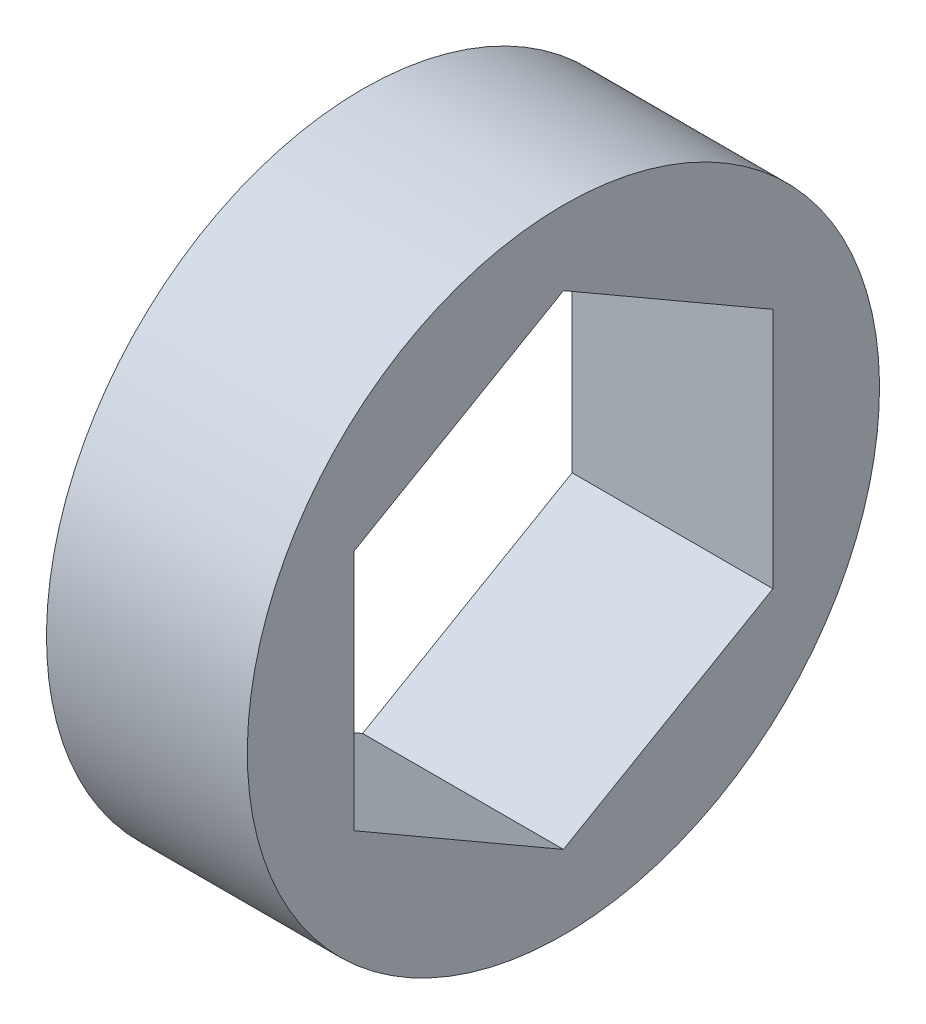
ISO-10303-21;
HEADER;
FILE_DESCRIPTION(('STEP AP214'),'2;1');
FILE_NAME('part.step','',(''),(''),'','','');
FILE_SCHEMA(('AUTOMOTIVE_DESIGN { 1 0 10303 214 1 1 1 1 }'));
ENDSEC;
DATA;
#1=APPLICATION_CONTEXT('core data for automotive mechanical design processes');
#2=APPLICATION_PROTOCOL_DEFINITION('international standard','automotive_design',2000,#1);
#3=PRODUCT_CONTEXT('',#1,'mechanical');
#4=PRODUCT('Part','Part','',(#3));
#5=PRODUCT_RELATED_PRODUCT_CATEGORY('part','',(#4));
#6=PRODUCT_DEFINITION_FORMATION('','',#4);
#7=PRODUCT_DEFINITION_CONTEXT('part definition',#1,'design');
#8=PRODUCT_DEFINITION('design','',#6,#7);
#9=PRODUCT_DEFINITION_SHAPE('','',#8);
#10=(LENGTH_UNIT() NAMED_UNIT(*) SI_UNIT(.MILLI.,.METRE.));
#11=(NAMED_UNIT(*) PLANE_ANGLE_UNIT() SI_UNIT($,.RADIAN.));
#12=(NAMED_UNIT(*) SI_UNIT($,.STERADIAN.) SOLID_ANGLE_UNIT());
#13=UNCERTAINTY_MEASURE_WITH_UNIT(LENGTH_MEASURE(1.E-05),#10,'distance_accuracy_value','');
#14=(GEOMETRIC_REPRESENTATION_CONTEXT(3) GLOBAL_UNCERTAINTY_ASSIGNED_CONTEXT((#13)) GLOBAL_UNIT_ASSIGNED_CONTEXT((#10,
#11,#12)) REPRESENTATION_CONTEXT('',''));
#15=CARTESIAN_POINT('',(0.,0.,0.));
#16=DIRECTION('',(0.,0.,1.));
#17=DIRECTION('',(1.,0.,0.));
#18=AXIS2_PLACEMENT_3D('',#15,#16,#17);
#19=CARTESIAN_POINT('',(-137.16,-96.8727012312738,310.598502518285));
#20=DIRECTION('',(1.,0.,0.));
#21=DIRECTION('',(0.,-1.,0.));
#22=AXIS2_PLACEMENT_3D('',#19,#20,#21);
#23=PLANE('',#22);
#24=CARTESIAN_POINT('',(-137.16,-96.8727012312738,310.598502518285));
#25=DIRECTION('',(1.,0.,0.));
#26=DIRECTION('',(0.,1.,0.));
#27=AXIS2_PLACEMENT_3D('',#24,#25,#26);
#28=CIRCLE('',#27,9.9949);
#29=CARTESIAN_POINT('',(-137.16,-86.8778012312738,310.598502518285));
#30=VERTEX_POINT('',#29);
#31=EDGE_CURVE('E11',#30,#30,#28,.T.);
#32=ORIENTED_EDGE('',*,*,#31,.F.);
#33=EDGE_LOOP('',(#32));
#34=FACE_BOUND('',#33,.T.);
#35=DIRECTION('',(0.,-1.,0.));
#36=VECTOR('',#35,1.);
#37=CARTESIAN_POINT('',(-137.16,-96.8727012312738,317.22401254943));
#38=LINE('',#37,#36);
#39=CARTESIAN_POINT('',(-137.16,-93.0474612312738,317.22401254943));
#40=VERTEX_POINT('',#39);
#41=CARTESIAN_POINT('',(-137.16,-100.697941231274,317.22401254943));
#42=VERTEX_POINT('',#41);
#43=EDGE_CURVE('E110',#40,#42,#38,.T.);
#44=ORIENTED_EDGE('',*,*,#43,.T.);
#45=DIRECTION('',(0.,-0.5,-0.866025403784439));
#46=VECTOR('',#45,1.);
#47=CARTESIAN_POINT('',(-137.16,-102.610561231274,313.911257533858));
#48=LINE('',#47,#46);
#49=CARTESIAN_POINT('',(-137.16,-104.523181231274,310.598502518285));
#50=VERTEX_POINT('',#49);
#51=EDGE_CURVE('E62',#42,#50,#48,.T.);
#52=ORIENTED_EDGE('',*,*,#51,.T.);
#53=DIRECTION('',(0.,0.5,-0.866025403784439));
#54=VECTOR('',#53,1.);
#55=CARTESIAN_POINT('',(-137.16,-102.610561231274,307.285747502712));
#56=LINE('',#55,#54);
#57=CARTESIAN_POINT('',(-137.16,-100.697941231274,303.97299248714));
#58=VERTEX_POINT('',#57);
#59=EDGE_CURVE('E155',#50,#58,#56,.T.);
#60=ORIENTED_EDGE('',*,*,#59,.T.);
#61=DIRECTION('',(0.,1.,0.));
#62=VECTOR('',#61,1.);
#63=CARTESIAN_POINT('',(-137.16,-96.8727012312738,303.97299248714));
#64=LINE('',#63,#62);
#65=CARTESIAN_POINT('',(-137.16,-93.0474612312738,303.97299248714));
#66=VERTEX_POINT('',#65);
#67=EDGE_CURVE('E135',#58,#66,#64,.T.);
#68=ORIENTED_EDGE('',*,*,#67,.T.);
#69=DIRECTION('',(0.,0.5,0.866025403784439));
#70=VECTOR('',#69,1.);
#71=CARTESIAN_POINT('',(-137.16,-91.1348412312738,307.285747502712));
#72=LINE('',#71,#70);
#73=CARTESIAN_POINT('',(-137.16,-89.2222212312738,310.598502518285));
#74=VERTEX_POINT('',#73);
#75=EDGE_CURVE('E143',#66,#74,#72,.T.);
#76=ORIENTED_EDGE('',*,*,#75,.T.);
#77=DIRECTION('',(0.,-0.5,0.866025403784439));
#78=VECTOR('',#77,1.);
#79=CARTESIAN_POINT('',(-137.16,-91.1348412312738,313.911257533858));
#80=LINE('',#79,#78);
#81=EDGE_CURVE('E114',#74,#40,#80,.T.);
#82=ORIENTED_EDGE('',*,*,#81,.T.);
#83=EDGE_LOOP('',(#44,#52,#60,#68,#76,#82));
#84=FACE_BOUND('',#83,.T.);
#85=ADVANCED_FACE('F17',(#34,#84),#23,.F.);
#86=CARTESIAN_POINT('',(-130.81,-96.8727012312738,310.598502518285));
#87=DIRECTION('',(1.,0.,0.));
#88=DIRECTION('',(0.,-1.,0.));
#89=AXIS2_PLACEMENT_3D('',#86,#87,#88);
#90=PLANE('',#89);
#91=CARTESIAN_POINT('',(-130.81,-96.8727012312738,310.598502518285));
#92=DIRECTION('',(1.,0.,0.));
#93=DIRECTION('',(0.,1.,0.));
#94=AXIS2_PLACEMENT_3D('',#91,#92,#93);
#95=CIRCLE('',#94,9.9949);
#96=CARTESIAN_POINT('',(-130.81,-86.8778012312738,310.598502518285));
#97=VERTEX_POINT('',#96);
#98=EDGE_CURVE('E26',#97,#97,#95,.T.);
#99=ORIENTED_EDGE('',*,*,#98,.T.);
#100=EDGE_LOOP('',(#99));
#101=FACE_BOUND('',#100,.T.);
#102=DIRECTION('',(0.,-1.,0.));
#103=VECTOR('',#102,1.);
#104=CARTESIAN_POINT('',(-130.81,-96.8727012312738,317.22401254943));
#105=LINE('',#104,#103);
#106=CARTESIAN_POINT('',(-130.81,-93.0474612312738,317.22401254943));
#107=VERTEX_POINT('',#106);
#108=CARTESIAN_POINT('',(-130.81,-100.697941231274,317.22401254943));
#109=VERTEX_POINT('',#108);
#110=EDGE_CURVE('E112',#107,#109,#105,.T.);
#111=ORIENTED_EDGE('',*,*,#110,.F.);
#112=DIRECTION('',(0.,-0.5,0.866025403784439));
#113=VECTOR('',#112,1.);
#114=CARTESIAN_POINT('',(-130.81,-91.1348412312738,313.911257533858));
#115=LINE('',#114,#113);
#116=CARTESIAN_POINT('',(-130.81,-89.2222212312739,310.598502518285));
#117=VERTEX_POINT('',#116);
#118=EDGE_CURVE('E140',#117,#107,#115,.T.);
#119=ORIENTED_EDGE('',*,*,#118,.F.);
#120=DIRECTION('',(0.,0.5,0.866025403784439));
#121=VECTOR('',#120,1.);
#122=CARTESIAN_POINT('',(-130.81,-91.1348412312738,307.285747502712));
#123=LINE('',#122,#121);
#124=CARTESIAN_POINT('',(-130.81,-93.0474612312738,303.97299248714));
#125=VERTEX_POINT('',#124);
#126=EDGE_CURVE('E132',#125,#117,#123,.T.);
#127=ORIENTED_EDGE('',*,*,#126,.F.);
#128=DIRECTION('',(0.,1.,0.));
#129=VECTOR('',#128,1.);
#130=CARTESIAN_POINT('',(-130.81,-96.8727012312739,303.97299248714));
#131=LINE('',#130,#129);
#132=CARTESIAN_POINT('',(-130.81,-100.697941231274,303.97299248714));
#133=VERTEX_POINT('',#132);
#134=EDGE_CURVE('E152',#133,#125,#131,.T.);
#135=ORIENTED_EDGE('',*,*,#134,.F.);
#136=DIRECTION('',(0.,0.5,-0.866025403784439));
#137=VECTOR('',#136,1.);
#138=CARTESIAN_POINT('',(-130.81,-102.610561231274,307.285747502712));
#139=LINE('',#138,#137);
#140=CARTESIAN_POINT('',(-130.81,-104.523181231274,310.598502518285));
#141=VERTEX_POINT('',#140);
#142=EDGE_CURVE('E73',#141,#133,#139,.T.);
#143=ORIENTED_EDGE('',*,*,#142,.F.);
#144=DIRECTION('',(0.,-0.5,-0.866025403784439));
#145=VECTOR('',#144,1.);
#146=CARTESIAN_POINT('',(-130.81,-102.610561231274,313.911257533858));
#147=LINE('',#146,#145);
#148=EDGE_CURVE('E104',#109,#141,#147,.T.);
#149=ORIENTED_EDGE('',*,*,#148,.F.);
#150=EDGE_LOOP('',(#111,#119,#127,#135,#143,#149));
#151=FACE_BOUND('',#150,.T.);
#152=ADVANCED_FACE('F168',(#101,#151),#90,.T.);
#153=CARTESIAN_POINT('',(-130.81,-96.8727012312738,310.598502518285));
#154=DIRECTION('',(-1.,0.,0.));
#155=DIRECTION('',(0.,-1.,0.));
#156=AXIS2_PLACEMENT_3D('',#153,#154,#155);
#157=CYLINDRICAL_SURFACE('',#156,9.9949);
#158=ORIENTED_EDGE('',*,*,#31,.T.);
#159=EDGE_LOOP('',(#158));
#160=FACE_BOUND('',#159,.T.);
#161=ORIENTED_EDGE('',*,*,#98,.F.);
#162=EDGE_LOOP('',(#161));
#163=FACE_BOUND('',#162,.T.);
#164=ADVANCED_FACE('F171',(#160,#163),#157,.T.);
#165=CARTESIAN_POINT('',(-130.81,-102.610561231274,313.911257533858));
#166=DIRECTION('',(0.,0.866025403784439,-0.5));
#167=DIRECTION('',(-1.,0.,0.));
#168=AXIS2_PLACEMENT_3D('',#165,#166,#167);
#169=PLANE('',#168);
#170=ORIENTED_EDGE('',*,*,#51,.F.);
#171=DIRECTION('',(-1.,0.,0.));
#172=VECTOR('',#171,1.);
#173=CARTESIAN_POINT('',(-130.81,-100.697941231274,317.22401254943));
#174=LINE('',#173,#172);
#175=EDGE_CURVE('E99',#109,#42,#174,.T.);
#176=ORIENTED_EDGE('',*,*,#175,.F.);
#177=ORIENTED_EDGE('',*,*,#148,.T.);
#178=DIRECTION('',(-1.,0.,0.));
#179=VECTOR('',#178,1.);
#180=CARTESIAN_POINT('',(-130.81,-104.523181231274,310.598502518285));
#181=LINE('',#180,#179);
#182=EDGE_CURVE('E101',#141,#50,#181,.T.);
#183=ORIENTED_EDGE('',*,*,#182,.T.);
#184=EDGE_LOOP('',(#170,#176,#177,#183));
#185=FACE_BOUND('',#184,.T.);
#186=ADVANCED_FACE('F98',(#185),#169,.T.);
#187=CARTESIAN_POINT('',(-130.81,-102.610561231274,307.285747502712));
#188=DIRECTION('',(0.,0.866025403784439,0.5));
#189=DIRECTION('',(1.,0.,0.));
#190=AXIS2_PLACEMENT_3D('',#187,#188,#189);
#191=PLANE('',#190);
#192=ORIENTED_EDGE('',*,*,#59,.F.);
#193=ORIENTED_EDGE('',*,*,#182,.F.);
#194=ORIENTED_EDGE('',*,*,#142,.T.);
#195=DIRECTION('',(-1.,0.,0.));
#196=VECTOR('',#195,1.);
#197=CARTESIAN_POINT('',(-130.81,-100.697941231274,303.97299248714));
#198=LINE('',#197,#196);
#199=EDGE_CURVE('E156',#133,#58,#198,.T.);
#200=ORIENTED_EDGE('',*,*,#199,.T.);
#201=EDGE_LOOP('',(#192,#193,#194,#200));
#202=FACE_BOUND('',#201,.T.);
#203=ADVANCED_FACE('F179',(#202),#191,.T.);
#204=CARTESIAN_POINT('',(-130.81,-96.8727012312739,303.97299248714));
#205=DIRECTION('',(0.,0.,1.));
#206=DIRECTION('',(1.,0.,0.));
#207=AXIS2_PLACEMENT_3D('',#204,#205,#206);
#208=PLANE('',#207);
#209=ORIENTED_EDGE('',*,*,#67,.F.);
#210=ORIENTED_EDGE('',*,*,#199,.F.);
#211=ORIENTED_EDGE('',*,*,#134,.T.);
#212=DIRECTION('',(-1.,0.,0.));
#213=VECTOR('',#212,1.);
#214=CARTESIAN_POINT('',(-130.81,-93.0474612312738,303.97299248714));
#215=LINE('',#214,#213);
#216=EDGE_CURVE('E136',#125,#66,#215,.T.);
#217=ORIENTED_EDGE('',*,*,#216,.T.);
#218=EDGE_LOOP('',(#209,#210,#211,#217));
#219=FACE_BOUND('',#218,.T.);
#220=ADVANCED_FACE('F219',(#219),#208,.T.);
#221=CARTESIAN_POINT('',(-130.81,-91.1348412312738,307.285747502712));
#222=DIRECTION('',(0.,-0.866025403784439,0.5));
#223=DIRECTION('',(-1.,0.,0.));
#224=AXIS2_PLACEMENT_3D('',#221,#222,#223);
#225=PLANE('',#224);
#226=ORIENTED_EDGE('',*,*,#75,.F.);
#227=ORIENTED_EDGE('',*,*,#216,.F.);
#228=ORIENTED_EDGE('',*,*,#126,.T.);
#229=DIRECTION('',(-1.,0.,0.));
#230=VECTOR('',#229,1.);
#231=CARTESIAN_POINT('',(-130.81,-89.2222212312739,310.598502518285));
#232=LINE('',#231,#230);
#233=EDGE_CURVE('E128',#117,#74,#232,.T.);
#234=ORIENTED_EDGE('',*,*,#233,.T.);
#235=EDGE_LOOP('',(#226,#227,#228,#234));
#236=FACE_BOUND('',#235,.T.);
#237=ADVANCED_FACE('F226',(#236),#225,.T.);
#238=CARTESIAN_POINT('',(-130.81,-91.1348412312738,313.911257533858));
#239=DIRECTION('',(0.,-0.866025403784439,-0.5));
#240=DIRECTION('',(0.,0.5,-0.866025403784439));
#241=AXIS2_PLACEMENT_3D('',#238,#239,#240);
#242=PLANE('',#241);
#243=ORIENTED_EDGE('',*,*,#81,.F.);
#244=ORIENTED_EDGE('',*,*,#233,.F.);
#245=ORIENTED_EDGE('',*,*,#118,.T.);
#246=DIRECTION('',(-1.,0.,0.));
#247=VECTOR('',#246,1.);
#248=CARTESIAN_POINT('',(-130.81,-93.0474612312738,317.22401254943));
#249=LINE('',#248,#247);
#250=EDGE_CURVE('E119',#107,#40,#249,.T.);
#251=ORIENTED_EDGE('',*,*,#250,.T.);
#252=EDGE_LOOP('',(#243,#244,#245,#251));
#253=FACE_BOUND('',#252,.T.);
#254=ADVANCED_FACE('F234',(#253),#242,.T.);
#255=CARTESIAN_POINT('',(-130.81,-96.8727012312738,317.22401254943));
#256=DIRECTION('',(0.,0.,-1.));
#257=DIRECTION('',(0.,-1.,0.));
#258=AXIS2_PLACEMENT_3D('',#255,#256,#257);
#259=PLANE('',#258);
#260=ORIENTED_EDGE('',*,*,#43,.F.);
#261=ORIENTED_EDGE('',*,*,#250,.F.);
#262=ORIENTED_EDGE('',*,*,#110,.T.);
#263=ORIENTED_EDGE('',*,*,#175,.T.);
#264=EDGE_LOOP('',(#260,#261,#262,#263));
#265=FACE_BOUND('',#264,.T.);
#266=ADVANCED_FACE('F108',(#265),#259,.T.);
#267=CLOSED_SHELL('',(#85,#152,#164,#186,#203,#220,#237,#254,#266));
#268=MANIFOLD_SOLID_BREP('B1',#267);
#269=ADVANCED_BREP_SHAPE_REPRESENTATION('',(#18,#268),#14);
#270=SHAPE_DEFINITION_REPRESENTATION(#9,#269);
ENDSEC;
END-ISO-10303-21;
